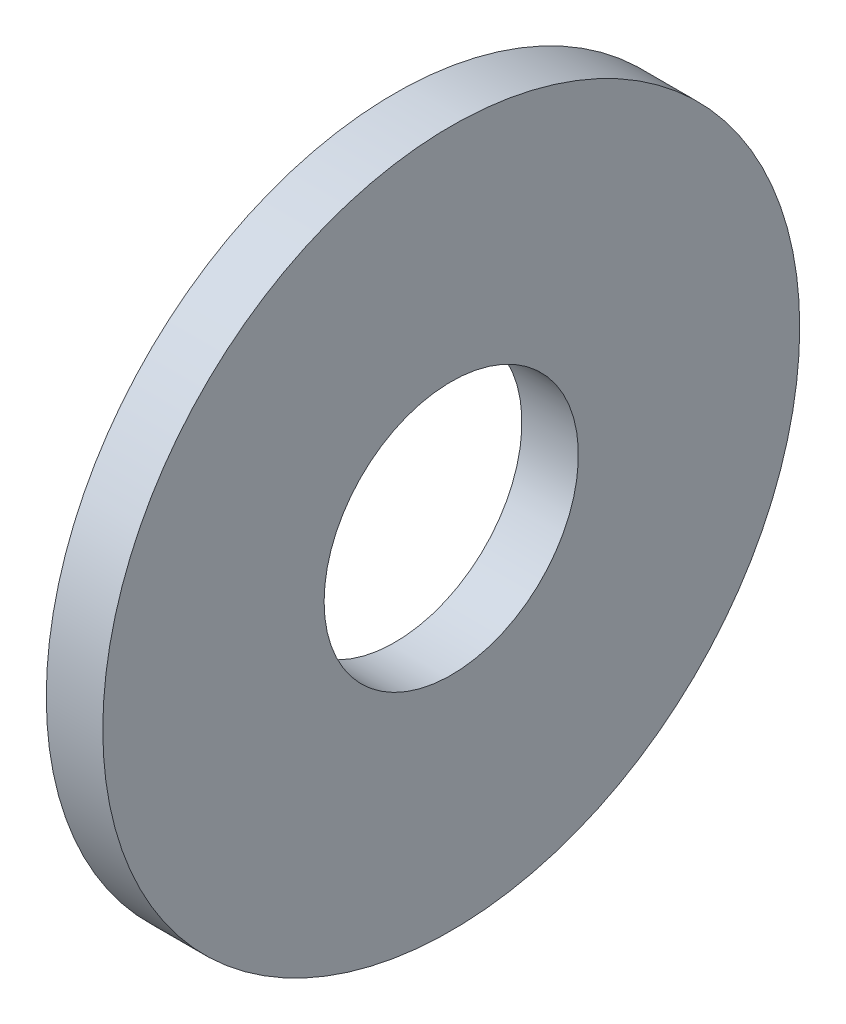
from build123d import *

# Parameters (mm, degrees)
SKETCH1_W = 3
SKETCH1_H = 11.75


with BuildPart() as part:
    # Sketch1 → Base-Revolve (revolve)
    with BuildSketch(Plane.XY, mode=Mode.PRIVATE) as base_revolve_sk:
        with Locations((-1.5, 12.625)):
            Rectangle(SKETCH1_W, SKETCH1_H)
    revolve(base_revolve_sk.sketch.rotate(Axis((-34.925, 0, 0), (1, 0, 0)), 90), axis=Axis((-34.925, 0, 0), (1, 0, 0)))


solid = part.part
